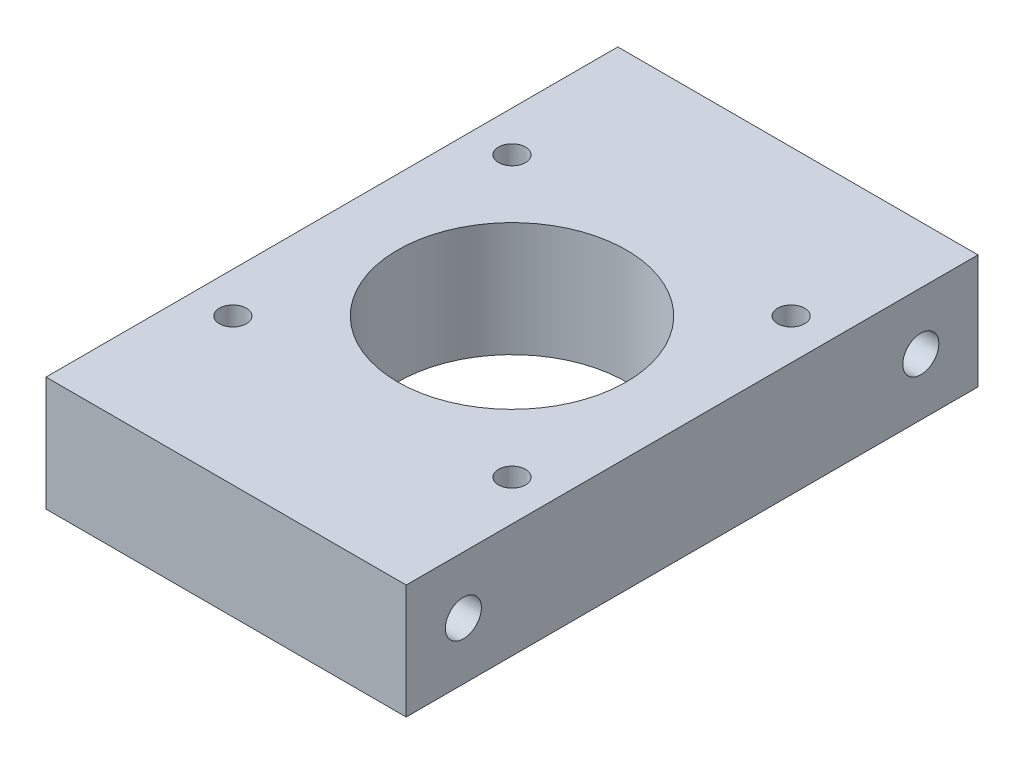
ISO-10303-21;
HEADER;
FILE_DESCRIPTION(('STEP AP214'),'2;1');
FILE_NAME('part.step','',(''),(''),'','','');
FILE_SCHEMA(('AUTOMOTIVE_DESIGN { 1 0 10303 214 1 1 1 1 }'));
ENDSEC;
DATA;
#1=APPLICATION_CONTEXT('core data for automotive mechanical design processes');
#2=APPLICATION_PROTOCOL_DEFINITION('international standard','automotive_design',2000,#1);
#3=PRODUCT_CONTEXT('',#1,'mechanical');
#4=PRODUCT('Part','Part','',(#3));
#5=PRODUCT_RELATED_PRODUCT_CATEGORY('part','',(#4));
#6=PRODUCT_DEFINITION_FORMATION('','',#4);
#7=PRODUCT_DEFINITION_CONTEXT('part definition',#1,'design');
#8=PRODUCT_DEFINITION('design','',#6,#7);
#9=PRODUCT_DEFINITION_SHAPE('','',#8);
#10=(LENGTH_UNIT() NAMED_UNIT(*) SI_UNIT(.MILLI.,.METRE.));
#11=(NAMED_UNIT(*) PLANE_ANGLE_UNIT() SI_UNIT($,.RADIAN.));
#12=(NAMED_UNIT(*) SI_UNIT($,.STERADIAN.) SOLID_ANGLE_UNIT());
#13=UNCERTAINTY_MEASURE_WITH_UNIT(LENGTH_MEASURE(1.E-05),#10,'distance_accuracy_value','');
#14=(GEOMETRIC_REPRESENTATION_CONTEXT(3) GLOBAL_UNCERTAINTY_ASSIGNED_CONTEXT((#13)) GLOBAL_UNIT_ASSIGNED_CONTEXT((#10,
#11,#12)) REPRESENTATION_CONTEXT('',''));
#15=CARTESIAN_POINT('',(0.,0.,0.));
#16=DIRECTION('',(0.,0.,1.));
#17=DIRECTION('',(1.,0.,0.));
#18=AXIS2_PLACEMENT_3D('',#15,#16,#17);
#19=CARTESIAN_POINT('',(-42.4065361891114,12.7,-18.0776867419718));
#20=DIRECTION('',(1.,0.,0.));
#21=DIRECTION('',(0.,0.,-1.));
#22=AXIS2_PLACEMENT_3D('',#19,#20,#21);
#23=PLANE('',#22);
#24=DIRECTION('',(0.,0.,1.));
#25=VECTOR('',#24,1.);
#26=CARTESIAN_POINT('',(-42.4065361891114,0.,-18.0776867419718));
#27=LINE('',#26,#25);
#28=CARTESIAN_POINT('',(-42.4065361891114,0.,-18.0776867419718));
#29=VERTEX_POINT('',#28);
#30=CARTESIAN_POINT('',(-42.4065361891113,0.,45.4223132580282));
#31=VERTEX_POINT('',#30);
#32=EDGE_CURVE('E96',#29,#31,#27,.T.);
#33=ORIENTED_EDGE('',*,*,#32,.T.);
#34=DIRECTION('',(0.,-1.,0.));
#35=VECTOR('',#34,1.);
#36=CARTESIAN_POINT('',(-42.4065361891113,12.7,45.4223132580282));
#37=LINE('',#36,#35);
#38=CARTESIAN_POINT('',(-42.4065361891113,12.7,45.4223132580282));
#39=VERTEX_POINT('',#38);
#40=EDGE_CURVE('E11',#39,#31,#37,.T.);
#41=ORIENTED_EDGE('',*,*,#40,.F.);
#42=DIRECTION('',(0.,0.,1.));
#43=VECTOR('',#42,1.);
#44=CARTESIAN_POINT('',(-42.4065361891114,12.7,-18.0776867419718));
#45=LINE('',#44,#43);
#46=CARTESIAN_POINT('',(-42.4065361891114,12.7,-18.0776867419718));
#47=VERTEX_POINT('',#46);
#48=EDGE_CURVE('E84',#47,#39,#45,.T.);
#49=ORIENTED_EDGE('',*,*,#48,.F.);
#50=DIRECTION('',(0.,-1.,0.));
#51=VECTOR('',#50,1.);
#52=CARTESIAN_POINT('',(-42.4065361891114,12.7,-18.0776867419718));
#53=LINE('',#52,#51);
#54=EDGE_CURVE('E92',#47,#29,#53,.T.);
#55=ORIENTED_EDGE('',*,*,#54,.T.);
#56=EDGE_LOOP('',(#33,#41,#49,#55));
#57=FACE_BOUND('',#56,.T.);
#58=ADVANCED_FACE('F33',(#57),#23,.F.);
#59=CARTESIAN_POINT('',(-42.4065361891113,12.7,45.4223132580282));
#60=DIRECTION('',(0.,0.,-1.));
#61=DIRECTION('',(-1.,0.,0.));
#62=AXIS2_PLACEMENT_3D('',#59,#60,#61);
#63=PLANE('',#62);
#64=DIRECTION('',(1.,0.,0.));
#65=VECTOR('',#64,1.);
#66=CARTESIAN_POINT('',(-42.4065361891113,0.,45.4223132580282));
#67=LINE('',#66,#65);
#68=CARTESIAN_POINT('',(-2.40653618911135,0.,45.4223132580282));
#69=VERTEX_POINT('',#68);
#70=EDGE_CURVE('E88',#31,#69,#67,.T.);
#71=ORIENTED_EDGE('',*,*,#70,.T.);
#72=DIRECTION('',(0.,-1.,0.));
#73=VECTOR('',#72,1.);
#74=CARTESIAN_POINT('',(-2.40653618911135,12.7,45.4223132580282));
#75=LINE('',#74,#73);
#76=CARTESIAN_POINT('',(-2.40653618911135,12.7,45.4223132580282));
#77=VERTEX_POINT('',#76);
#78=EDGE_CURVE('E41',#77,#69,#75,.T.);
#79=ORIENTED_EDGE('',*,*,#78,.F.);
#80=DIRECTION('',(1.,0.,0.));
#81=VECTOR('',#80,1.);
#82=CARTESIAN_POINT('',(-42.4065361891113,12.7,45.4223132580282));
#83=LINE('',#82,#81);
#84=EDGE_CURVE('E79',#39,#77,#83,.T.);
#85=ORIENTED_EDGE('',*,*,#84,.F.);
#86=ORIENTED_EDGE('',*,*,#40,.T.);
#87=EDGE_LOOP('',(#71,#79,#85,#86));
#88=FACE_BOUND('',#87,.T.);
#89=ADVANCED_FACE('F87',(#88),#63,.F.);
#90=CARTESIAN_POINT('',(-2.40653618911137,12.7,-18.0776867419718));
#91=DIRECTION('',(-1.,0.,0.));
#92=DIRECTION('',(0.,0.,1.));
#93=AXIS2_PLACEMENT_3D('',#90,#91,#92);
#94=PLANE('',#93);
#95=CARTESIAN_POINT('',(-2.40653618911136,6.35,-11.7276867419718));
#96=DIRECTION('',(1.,0.,0.));
#97=DIRECTION('',(0.,0.,-1.));
#98=AXIS2_PLACEMENT_3D('',#95,#96,#97);
#99=CIRCLE('',#98,2.);
#100=CARTESIAN_POINT('',(-2.40653618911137,6.35,-13.7276867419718));
#101=VERTEX_POINT('',#100);
#102=EDGE_CURVE('E116',#101,#101,#99,.T.);
#103=ORIENTED_EDGE('',*,*,#102,.F.);
#104=EDGE_LOOP('',(#103));
#105=FACE_BOUND('',#104,.T.);
#106=CARTESIAN_POINT('',(-2.40653618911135,6.35,39.0723132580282));
#107=DIRECTION('',(1.,0.,0.));
#108=DIRECTION('',(0.,0.,-1.));
#109=AXIS2_PLACEMENT_3D('',#106,#107,#108);
#110=CIRCLE('',#109,2.);
#111=CARTESIAN_POINT('',(-2.40653618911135,6.35,37.0723132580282));
#112=VERTEX_POINT('',#111);
#113=EDGE_CURVE('E110',#112,#112,#110,.T.);
#114=ORIENTED_EDGE('',*,*,#113,.F.);
#115=EDGE_LOOP('',(#114));
#116=FACE_BOUND('',#115,.T.);
#117=DIRECTION('',(0.,0.,-1.));
#118=VECTOR('',#117,1.);
#119=CARTESIAN_POINT('',(-2.40653618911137,0.,-18.0776867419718));
#120=LINE('',#119,#118);
#121=CARTESIAN_POINT('',(-2.40653618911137,0.,-18.0776867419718));
#122=VERTEX_POINT('',#121);
#123=EDGE_CURVE('E66',#69,#122,#120,.T.);
#124=ORIENTED_EDGE('',*,*,#123,.T.);
#125=DIRECTION('',(0.,-1.,0.));
#126=VECTOR('',#125,1.);
#127=CARTESIAN_POINT('',(-2.40653618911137,12.7,-18.0776867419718));
#128=LINE('',#127,#126);
#129=CARTESIAN_POINT('',(-2.40653618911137,12.7,-18.0776867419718));
#130=VERTEX_POINT('',#129);
#131=EDGE_CURVE('E89',#130,#122,#128,.T.);
#132=ORIENTED_EDGE('',*,*,#131,.F.);
#133=DIRECTION('',(0.,0.,-1.));
#134=VECTOR('',#133,1.);
#135=CARTESIAN_POINT('',(-2.40653618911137,12.7,-18.0776867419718));
#136=LINE('',#135,#134);
#137=EDGE_CURVE('E82',#77,#130,#136,.T.);
#138=ORIENTED_EDGE('',*,*,#137,.F.);
#139=ORIENTED_EDGE('',*,*,#78,.T.);
#140=EDGE_LOOP('',(#124,#132,#138,#139));
#141=FACE_BOUND('',#140,.T.);
#142=ADVANCED_FACE('F90',(#105,#116,#141),#94,.F.);
#143=CARTESIAN_POINT('',(-42.4065361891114,12.7,-18.0776867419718));
#144=DIRECTION('',(0.,0.,1.));
#145=DIRECTION('',(1.,0.,0.));
#146=AXIS2_PLACEMENT_3D('',#143,#144,#145);
#147=PLANE('',#146);
#148=DIRECTION('',(-1.,0.,0.));
#149=VECTOR('',#148,1.);
#150=CARTESIAN_POINT('',(-42.4065361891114,0.,-18.0776867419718));
#151=LINE('',#150,#149);
#152=EDGE_CURVE('E72',#122,#29,#151,.T.);
#153=ORIENTED_EDGE('',*,*,#152,.T.);
#154=ORIENTED_EDGE('',*,*,#54,.F.);
#155=DIRECTION('',(-1.,0.,0.));
#156=VECTOR('',#155,1.);
#157=CARTESIAN_POINT('',(-42.4065361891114,12.7,-18.0776867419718));
#158=LINE('',#157,#156);
#159=EDGE_CURVE('E49',#130,#47,#158,.T.);
#160=ORIENTED_EDGE('',*,*,#159,.F.);
#161=ORIENTED_EDGE('',*,*,#131,.T.);
#162=EDGE_LOOP('',(#153,#154,#160,#161));
#163=FACE_BOUND('',#162,.T.);
#164=ADVANCED_FACE('F104',(#163),#147,.F.);
#165=CARTESIAN_POINT('',(-42.4065361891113,12.7,45.4223132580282));
#166=DIRECTION('',(0.,1.,0.));
#167=DIRECTION('',(0.,0.,1.));
#168=AXIS2_PLACEMENT_3D('',#165,#166,#167);
#169=PLANE('',#168);
#170=CARTESIAN_POINT('',(-37.9065361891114,12.7,29.1723132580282));
#171=DIRECTION('',(0.,1.,0.));
#172=DIRECTION('',(0.,0.,1.));
#173=AXIS2_PLACEMENT_3D('',#170,#171,#172);
#174=CIRCLE('',#173,1.5);
#175=CARTESIAN_POINT('',(-37.9065361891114,12.7,30.6723132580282));
#176=VERTEX_POINT('',#175);
#177=EDGE_CURVE('E146',#176,#176,#174,.T.);
#178=ORIENTED_EDGE('',*,*,#177,.F.);
#179=EDGE_LOOP('',(#178));
#180=FACE_BOUND('',#179,.T.);
#181=CARTESIAN_POINT('',(-6.90653618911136,12.7,29.1723132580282));
#182=DIRECTION('',(0.,1.,0.));
#183=DIRECTION('',(0.,0.,1.));
#184=AXIS2_PLACEMENT_3D('',#181,#182,#183);
#185=CIRCLE('',#184,1.5);
#186=CARTESIAN_POINT('',(-6.90653618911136,12.7,30.6723132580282));
#187=VERTEX_POINT('',#186);
#188=EDGE_CURVE('E140',#187,#187,#185,.T.);
#189=ORIENTED_EDGE('',*,*,#188,.F.);
#190=EDGE_LOOP('',(#189));
#191=FACE_BOUND('',#190,.T.);
#192=CARTESIAN_POINT('',(-6.90653618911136,12.7,-1.82768674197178));
#193=DIRECTION('',(0.,1.,0.));
#194=DIRECTION('',(0.,0.,1.));
#195=AXIS2_PLACEMENT_3D('',#192,#193,#194);
#196=CIRCLE('',#195,1.5);
#197=CARTESIAN_POINT('',(-6.90653618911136,12.7,-0.327686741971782));
#198=VERTEX_POINT('',#197);
#199=EDGE_CURVE('E134',#198,#198,#196,.T.);
#200=ORIENTED_EDGE('',*,*,#199,.F.);
#201=EDGE_LOOP('',(#200));
#202=FACE_BOUND('',#201,.T.);
#203=CARTESIAN_POINT('',(-37.9065361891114,12.7,-1.82768674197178));
#204=DIRECTION('',(0.,1.,0.));
#205=DIRECTION('',(0.,0.,1.));
#206=AXIS2_PLACEMENT_3D('',#203,#204,#205);
#207=CIRCLE('',#206,1.5);
#208=CARTESIAN_POINT('',(-37.9065361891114,12.7,-0.327686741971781));
#209=VERTEX_POINT('',#208);
#210=EDGE_CURVE('E128',#209,#209,#207,.T.);
#211=ORIENTED_EDGE('',*,*,#210,.F.);
#212=EDGE_LOOP('',(#211));
#213=FACE_BOUND('',#212,.T.);
#214=CARTESIAN_POINT('',(-22.4065361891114,12.7,13.6723132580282));
#215=DIRECTION('',(0.,1.,0.));
#216=DIRECTION('',(0.,0.,1.));
#217=AXIS2_PLACEMENT_3D('',#214,#215,#216);
#218=CIRCLE('',#217,12.7);
#219=CARTESIAN_POINT('',(-22.4065361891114,12.7,26.3723132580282));
#220=VERTEX_POINT('',#219);
#221=EDGE_CURVE('E122',#220,#220,#218,.T.);
#222=ORIENTED_EDGE('',*,*,#221,.F.);
#223=EDGE_LOOP('',(#222));
#224=FACE_BOUND('',#223,.T.);
#225=ORIENTED_EDGE('',*,*,#48,.T.);
#226=ORIENTED_EDGE('',*,*,#84,.T.);
#227=ORIENTED_EDGE('',*,*,#137,.T.);
#228=ORIENTED_EDGE('',*,*,#159,.T.);
#229=EDGE_LOOP('',(#225,#226,#227,#228));
#230=FACE_BOUND('',#229,.T.);
#231=ADVANCED_FACE('F80',(#180,#191,#202,#213,#224,#230),#169,.T.);
#232=CARTESIAN_POINT('',(-42.4065361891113,0.,45.4223132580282));
#233=DIRECTION('',(0.,1.,0.));
#234=DIRECTION('',(0.,0.,1.));
#235=AXIS2_PLACEMENT_3D('',#232,#233,#234);
#236=PLANE('',#235);
#237=CARTESIAN_POINT('',(-37.9065361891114,0.,29.1723132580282));
#238=DIRECTION('',(0.,1.,0.));
#239=DIRECTION('',(0.,0.,1.));
#240=AXIS2_PLACEMENT_3D('',#237,#238,#239);
#241=CIRCLE('',#240,1.5);
#242=CARTESIAN_POINT('',(-37.9065361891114,0.,30.6723132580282));
#243=VERTEX_POINT('',#242);
#244=EDGE_CURVE('E143',#243,#243,#241,.T.);
#245=ORIENTED_EDGE('',*,*,#244,.T.);
#246=EDGE_LOOP('',(#245));
#247=FACE_BOUND('',#246,.T.);
#248=CARTESIAN_POINT('',(-6.90653618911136,0.,29.1723132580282));
#249=DIRECTION('',(0.,1.,0.));
#250=DIRECTION('',(0.,0.,1.));
#251=AXIS2_PLACEMENT_3D('',#248,#249,#250);
#252=CIRCLE('',#251,1.5);
#253=CARTESIAN_POINT('',(-6.90653618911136,0.,30.6723132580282));
#254=VERTEX_POINT('',#253);
#255=EDGE_CURVE('E137',#254,#254,#252,.T.);
#256=ORIENTED_EDGE('',*,*,#255,.T.);
#257=EDGE_LOOP('',(#256));
#258=FACE_BOUND('',#257,.T.);
#259=CARTESIAN_POINT('',(-6.90653618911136,0.,-1.82768674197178));
#260=DIRECTION('',(0.,1.,0.));
#261=DIRECTION('',(0.,0.,1.));
#262=AXIS2_PLACEMENT_3D('',#259,#260,#261);
#263=CIRCLE('',#262,1.5);
#264=CARTESIAN_POINT('',(-6.90653618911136,0.,-0.327686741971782));
#265=VERTEX_POINT('',#264);
#266=EDGE_CURVE('E131',#265,#265,#263,.T.);
#267=ORIENTED_EDGE('',*,*,#266,.T.);
#268=EDGE_LOOP('',(#267));
#269=FACE_BOUND('',#268,.T.);
#270=CARTESIAN_POINT('',(-37.9065361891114,0.,-1.82768674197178));
#271=DIRECTION('',(0.,1.,0.));
#272=DIRECTION('',(0.,0.,1.));
#273=AXIS2_PLACEMENT_3D('',#270,#271,#272);
#274=CIRCLE('',#273,1.5);
#275=CARTESIAN_POINT('',(-37.9065361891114,0.,-0.327686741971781));
#276=VERTEX_POINT('',#275);
#277=EDGE_CURVE('E125',#276,#276,#274,.T.);
#278=ORIENTED_EDGE('',*,*,#277,.T.);
#279=EDGE_LOOP('',(#278));
#280=FACE_BOUND('',#279,.T.);
#281=CARTESIAN_POINT('',(-22.4065361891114,0.,13.6723132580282));
#282=DIRECTION('',(0.,1.,0.));
#283=DIRECTION('',(0.,0.,1.));
#284=AXIS2_PLACEMENT_3D('',#281,#282,#283);
#285=CIRCLE('',#284,12.7);
#286=CARTESIAN_POINT('',(-22.4065361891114,0.,26.3723132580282));
#287=VERTEX_POINT('',#286);
#288=EDGE_CURVE('E119',#287,#287,#285,.T.);
#289=ORIENTED_EDGE('',*,*,#288,.T.);
#290=EDGE_LOOP('',(#289));
#291=FACE_BOUND('',#290,.T.);
#292=ORIENTED_EDGE('',*,*,#32,.F.);
#293=ORIENTED_EDGE('',*,*,#152,.F.);
#294=ORIENTED_EDGE('',*,*,#123,.F.);
#295=ORIENTED_EDGE('',*,*,#70,.F.);
#296=EDGE_LOOP('',(#292,#293,#294,#295));
#297=FACE_BOUND('',#296,.T.);
#298=ADVANCED_FACE('F107',(#247,#258,#269,#280,#291,#297),#236,.F.);
#299=CARTESIAN_POINT('',(-27.8065361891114,6.35,39.0723132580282));
#300=DIRECTION('',(1.,0.,0.));
#301=DIRECTION('',(0.,0.,-1.));
#302=AXIS2_PLACEMENT_3D('',#299,#300,#301);
#303=CYLINDRICAL_SURFACE('',#302,2.);
#304=CARTESIAN_POINT('',(-27.8065361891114,6.35,39.0723132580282));
#305=DIRECTION('',(1.,0.,0.));
#306=DIRECTION('',(0.,0.,-1.));
#307=AXIS2_PLACEMENT_3D('',#304,#305,#306);
#308=CIRCLE('',#307,2.);
#309=CARTESIAN_POINT('',(-27.8065361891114,6.35,37.0723132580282));
#310=VERTEX_POINT('',#309);
#311=EDGE_CURVE('E99',#310,#310,#308,.T.);
#312=ORIENTED_EDGE('',*,*,#311,.F.);
#313=EDGE_LOOP('',(#312));
#314=FACE_BOUND('',#313,.T.);
#315=ORIENTED_EDGE('',*,*,#113,.T.);
#316=EDGE_LOOP('',(#315));
#317=FACE_BOUND('',#316,.T.);
#318=ADVANCED_FACE('F202',(#314,#317),#303,.F.);
#319=CARTESIAN_POINT('',(-27.8065361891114,6.35,39.0723132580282));
#320=DIRECTION('',(1.,0.,0.));
#321=DIRECTION('',(0.,0.,-1.));
#322=AXIS2_PLACEMENT_3D('',#319,#320,#321);
#323=PLANE('',#322);
#324=ORIENTED_EDGE('',*,*,#311,.T.);
#325=EDGE_LOOP('',(#324));
#326=FACE_BOUND('',#325,.T.);
#327=ADVANCED_FACE('F206',(#326),#323,.T.);
#328=CARTESIAN_POINT('',(-27.8065361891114,6.35,-11.7276867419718));
#329=DIRECTION('',(1.,0.,0.));
#330=DIRECTION('',(0.,0.,-1.));
#331=AXIS2_PLACEMENT_3D('',#328,#329,#330);
#332=CYLINDRICAL_SURFACE('',#331,2.);
#333=CARTESIAN_POINT('',(-27.8065361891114,6.35,-11.7276867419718));
#334=DIRECTION('',(1.,0.,0.));
#335=DIRECTION('',(0.,0.,-1.));
#336=AXIS2_PLACEMENT_3D('',#333,#334,#335);
#337=CIRCLE('',#336,2.);
#338=CARTESIAN_POINT('',(-27.8065361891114,6.35,-13.7276867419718));
#339=VERTEX_POINT('',#338);
#340=EDGE_CURVE('E113',#339,#339,#337,.T.);
#341=ORIENTED_EDGE('',*,*,#340,.F.);
#342=EDGE_LOOP('',(#341));
#343=FACE_BOUND('',#342,.T.);
#344=ORIENTED_EDGE('',*,*,#102,.T.);
#345=EDGE_LOOP('',(#344));
#346=FACE_BOUND('',#345,.T.);
#347=ADVANCED_FACE('F185',(#343,#346),#332,.F.);
#348=CARTESIAN_POINT('',(-27.8065361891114,6.35,-11.7276867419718));
#349=DIRECTION('',(1.,0.,0.));
#350=DIRECTION('',(0.,0.,-1.));
#351=AXIS2_PLACEMENT_3D('',#348,#349,#350);
#352=PLANE('',#351);
#353=ORIENTED_EDGE('',*,*,#340,.T.);
#354=EDGE_LOOP('',(#353));
#355=FACE_BOUND('',#354,.T.);
#356=ADVANCED_FACE('F175',(#355),#352,.T.);
#357=CARTESIAN_POINT('',(-22.4065361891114,0.,13.6723132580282));
#358=DIRECTION('',(0.,1.,0.));
#359=DIRECTION('',(0.,0.,1.));
#360=AXIS2_PLACEMENT_3D('',#357,#358,#359);
#361=CYLINDRICAL_SURFACE('',#360,12.7);
#362=ORIENTED_EDGE('',*,*,#288,.F.);
#363=EDGE_LOOP('',(#362));
#364=FACE_BOUND('',#363,.T.);
#365=ORIENTED_EDGE('',*,*,#221,.T.);
#366=EDGE_LOOP('',(#365));
#367=FACE_BOUND('',#366,.T.);
#368=ADVANCED_FACE('F172',(#364,#367),#361,.F.);
#369=CARTESIAN_POINT('',(-37.9065361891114,0.,-1.82768674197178));
#370=DIRECTION('',(0.,1.,0.));
#371=DIRECTION('',(0.,0.,1.));
#372=AXIS2_PLACEMENT_3D('',#369,#370,#371);
#373=CYLINDRICAL_SURFACE('',#372,1.5);
#374=ORIENTED_EDGE('',*,*,#277,.F.);
#375=EDGE_LOOP('',(#374));
#376=FACE_BOUND('',#375,.T.);
#377=ORIENTED_EDGE('',*,*,#210,.T.);
#378=EDGE_LOOP('',(#377));
#379=FACE_BOUND('',#378,.T.);
#380=ADVANCED_FACE('F174',(#376,#379),#373,.F.);
#381=CARTESIAN_POINT('',(-6.90653618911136,0.,-1.82768674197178));
#382=DIRECTION('',(0.,1.,0.));
#383=DIRECTION('',(0.,0.,1.));
#384=AXIS2_PLACEMENT_3D('',#381,#382,#383);
#385=CYLINDRICAL_SURFACE('',#384,1.5);
#386=ORIENTED_EDGE('',*,*,#266,.F.);
#387=EDGE_LOOP('',(#386));
#388=FACE_BOUND('',#387,.T.);
#389=ORIENTED_EDGE('',*,*,#199,.T.);
#390=EDGE_LOOP('',(#389));
#391=FACE_BOUND('',#390,.T.);
#392=ADVANCED_FACE('F182',(#388,#391),#385,.F.);
#393=CARTESIAN_POINT('',(-6.90653618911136,0.,29.1723132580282));
#394=DIRECTION('',(0.,1.,0.));
#395=DIRECTION('',(0.,0.,1.));
#396=AXIS2_PLACEMENT_3D('',#393,#394,#395);
#397=CYLINDRICAL_SURFACE('',#396,1.5);
#398=ORIENTED_EDGE('',*,*,#255,.F.);
#399=EDGE_LOOP('',(#398));
#400=FACE_BOUND('',#399,.T.);
#401=ORIENTED_EDGE('',*,*,#188,.T.);
#402=EDGE_LOOP('',(#401));
#403=FACE_BOUND('',#402,.T.);
#404=ADVANCED_FACE('F157',(#400,#403),#397,.F.);
#405=CARTESIAN_POINT('',(-37.9065361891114,0.,29.1723132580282));
#406=DIRECTION('',(0.,1.,0.));
#407=DIRECTION('',(0.,0.,1.));
#408=AXIS2_PLACEMENT_3D('',#405,#406,#407);
#409=CYLINDRICAL_SURFACE('',#408,1.5);
#410=ORIENTED_EDGE('',*,*,#244,.F.);
#411=EDGE_LOOP('',(#410));
#412=FACE_BOUND('',#411,.T.);
#413=ORIENTED_EDGE('',*,*,#177,.T.);
#414=EDGE_LOOP('',(#413));
#415=FACE_BOUND('',#414,.T.);
#416=ADVANCED_FACE('F154',(#412,#415),#409,.F.);
#417=CLOSED_SHELL('',(#58,#89,#142,#164,#231,#298,#318,#327,#347,#356,#368,#380,#392,#404,#416));
#418=MANIFOLD_SOLID_BREP('B2',#417);
#419=ADVANCED_BREP_SHAPE_REPRESENTATION('',(#18,#418),#14);
#420=SHAPE_DEFINITION_REPRESENTATION(#9,#419);
ENDSEC;
END-ISO-10303-21;
